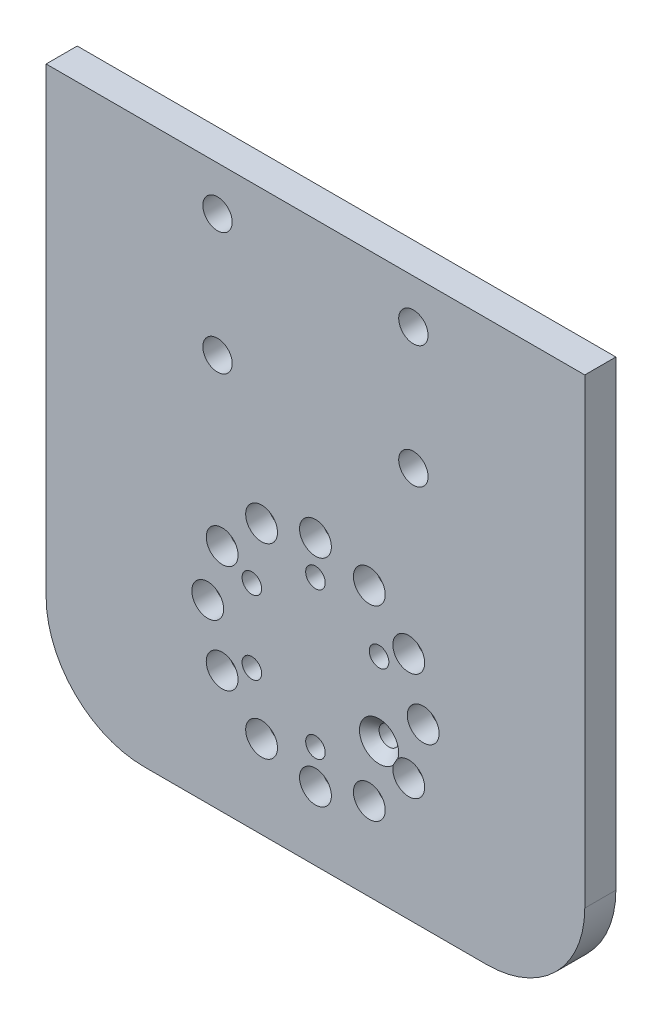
ISO-10303-21;
HEADER;
FILE_DESCRIPTION(('STEP AP214'),'2;1');
FILE_NAME('part.step','',(''),(''),'','','');
FILE_SCHEMA(('AUTOMOTIVE_DESIGN { 1 0 10303 214 1 1 1 1 }'));
ENDSEC;
DATA;
#1=APPLICATION_CONTEXT('core data for automotive mechanical design processes');
#2=APPLICATION_PROTOCOL_DEFINITION('international standard','automotive_design',2000,#1);
#3=PRODUCT_CONTEXT('',#1,'mechanical');
#4=PRODUCT('Part','Part','',(#3));
#5=PRODUCT_RELATED_PRODUCT_CATEGORY('part','',(#4));
#6=PRODUCT_DEFINITION_FORMATION('','',#4);
#7=PRODUCT_DEFINITION_CONTEXT('part definition',#1,'design');
#8=PRODUCT_DEFINITION('design','',#6,#7);
#9=PRODUCT_DEFINITION_SHAPE('','',#8);
#10=(LENGTH_UNIT() NAMED_UNIT(*) SI_UNIT(.MILLI.,.METRE.));
#11=(NAMED_UNIT(*) PLANE_ANGLE_UNIT() SI_UNIT($,.RADIAN.));
#12=(NAMED_UNIT(*) SI_UNIT($,.STERADIAN.) SOLID_ANGLE_UNIT());
#13=UNCERTAINTY_MEASURE_WITH_UNIT(LENGTH_MEASURE(1.E-05),#10,'distance_accuracy_value','');
#14=(GEOMETRIC_REPRESENTATION_CONTEXT(3) GLOBAL_UNCERTAINTY_ASSIGNED_CONTEXT((#13)) GLOBAL_UNIT_ASSIGNED_CONTEXT((#10,
#11,#12)) REPRESENTATION_CONTEXT('',''));
#15=CARTESIAN_POINT('',(0.,0.,0.));
#16=DIRECTION('',(0.,0.,1.));
#17=DIRECTION('',(1.,0.,0.));
#18=AXIS2_PLACEMENT_3D('',#15,#16,#17);
#19=CARTESIAN_POINT('',(0.,22.,6.35));
#20=DIRECTION('',(0.,0.,-1.));
#21=DIRECTION('',(-1.,0.,0.));
#22=AXIS2_PLACEMENT_3D('',#19,#20,#21);
#23=CYLINDRICAL_SURFACE('',#22,1.5);
#24=CARTESIAN_POINT('',(0.,22.,0.));
#25=DIRECTION('',(0.,0.,1.));
#26=DIRECTION('',(1.,0.,0.));
#27=AXIS2_PLACEMENT_3D('',#24,#25,#26);
#28=CIRCLE('',#27,1.5);
#29=CARTESIAN_POINT('',(1.5,22.,0.));
#30=VERTEX_POINT('',#29);
#31=EDGE_CURVE('E258',#30,#30,#28,.T.);
#32=ORIENTED_EDGE('',*,*,#31,.F.);
#33=EDGE_LOOP('',(#32));
#34=FACE_BOUND('',#33,.T.);
#35=CARTESIAN_POINT('',(0.,22.,1.85));
#36=DIRECTION('',(0.,0.,1.));
#37=DIRECTION('',(1.,0.,0.));
#38=AXIS2_PLACEMENT_3D('',#35,#36,#37);
#39=CIRCLE('',#38,1.5);
#40=CARTESIAN_POINT('',(1.5,22.,1.85));
#41=VERTEX_POINT('',#40);
#42=EDGE_CURVE('E176',#41,#41,#39,.T.);
#43=ORIENTED_EDGE('',*,*,#42,.T.);
#44=EDGE_LOOP('',(#43));
#45=FACE_BOUND('',#44,.T.);
#46=ADVANCED_FACE('F39',(#34,#45),#23,.F.);
#47=CARTESIAN_POINT('',(11.,19.0525588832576,6.35));
#48=DIRECTION('',(0.,0.,-1.));
#49=DIRECTION('',(-1.,0.,0.));
#50=AXIS2_PLACEMENT_3D('',#47,#48,#49);
#51=CYLINDRICAL_SURFACE('',#50,1.5);
#52=CARTESIAN_POINT('',(11.,19.0525588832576,0.));
#53=DIRECTION('',(0.,0.,1.));
#54=DIRECTION('',(1.,0.,0.));
#55=AXIS2_PLACEMENT_3D('',#52,#53,#54);
#56=CIRCLE('',#55,1.5);
#57=CARTESIAN_POINT('',(12.5,19.0525588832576,0.));
#58=VERTEX_POINT('',#57);
#59=EDGE_CURVE('E233',#58,#58,#56,.T.);
#60=ORIENTED_EDGE('',*,*,#59,.F.);
#61=EDGE_LOOP('',(#60));
#62=FACE_BOUND('',#61,.T.);
#63=CARTESIAN_POINT('',(11.,19.0525588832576,1.85));
#64=DIRECTION('',(0.,0.,1.));
#65=DIRECTION('',(1.,0.,0.));
#66=AXIS2_PLACEMENT_3D('',#63,#64,#65);
#67=CIRCLE('',#66,1.5);
#68=CARTESIAN_POINT('',(12.5,19.0525588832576,1.85));
#69=VERTEX_POINT('',#68);
#70=EDGE_CURVE('E339',#69,#69,#67,.T.);
#71=ORIENTED_EDGE('',*,*,#70,.T.);
#72=EDGE_LOOP('',(#71));
#73=FACE_BOUND('',#72,.T.);
#74=ADVANCED_FACE('F422',(#62,#73),#51,.F.);
#75=CARTESIAN_POINT('',(19.0525588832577,11.,6.35));
#76=DIRECTION('',(0.,0.,-1.));
#77=DIRECTION('',(-1.,0.,0.));
#78=AXIS2_PLACEMENT_3D('',#75,#76,#77);
#79=CYLINDRICAL_SURFACE('',#78,1.5);
#80=CARTESIAN_POINT('',(19.0525588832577,11.,0.));
#81=DIRECTION('',(0.,0.,1.));
#82=DIRECTION('',(1.,0.,0.));
#83=AXIS2_PLACEMENT_3D('',#80,#81,#82);
#84=CIRCLE('',#83,1.5);
#85=CARTESIAN_POINT('',(20.5525588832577,11.,0.));
#86=VERTEX_POINT('',#85);
#87=EDGE_CURVE('E226',#86,#86,#84,.T.);
#88=ORIENTED_EDGE('',*,*,#87,.F.);
#89=EDGE_LOOP('',(#88));
#90=FACE_BOUND('',#89,.T.);
#91=CARTESIAN_POINT('',(19.0525588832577,11.,1.85));
#92=DIRECTION('',(0.,0.,1.));
#93=DIRECTION('',(1.,0.,0.));
#94=AXIS2_PLACEMENT_3D('',#91,#92,#93);
#95=CIRCLE('',#94,1.5);
#96=CARTESIAN_POINT('',(20.5525588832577,11.,1.85));
#97=VERTEX_POINT('',#96);
#98=EDGE_CURVE('E337',#97,#97,#95,.T.);
#99=ORIENTED_EDGE('',*,*,#98,.T.);
#100=EDGE_LOOP('',(#99));
#101=FACE_BOUND('',#100,.T.);
#102=ADVANCED_FACE('F429',(#90,#101),#79,.F.);
#103=CARTESIAN_POINT('',(22.,0.,6.35));
#104=DIRECTION('',(0.,0.,-1.));
#105=DIRECTION('',(-1.,0.,0.));
#106=AXIS2_PLACEMENT_3D('',#103,#104,#105);
#107=CYLINDRICAL_SURFACE('',#106,1.5);
#108=CARTESIAN_POINT('',(22.,0.,0.));
#109=DIRECTION('',(0.,0.,1.));
#110=DIRECTION('',(1.,0.,0.));
#111=AXIS2_PLACEMENT_3D('',#108,#109,#110);
#112=CIRCLE('',#111,1.5);
#113=CARTESIAN_POINT('',(23.5,0.,0.));
#114=VERTEX_POINT('',#113);
#115=EDGE_CURVE('E223',#114,#114,#112,.T.);
#116=ORIENTED_EDGE('',*,*,#115,.F.);
#117=EDGE_LOOP('',(#116));
#118=FACE_BOUND('',#117,.T.);
#119=CARTESIAN_POINT('',(22.,0.,1.85));
#120=DIRECTION('',(0.,0.,1.));
#121=DIRECTION('',(1.,0.,0.));
#122=AXIS2_PLACEMENT_3D('',#119,#120,#121);
#123=CIRCLE('',#122,1.5);
#124=CARTESIAN_POINT('',(23.5,0.,1.85));
#125=VERTEX_POINT('',#124);
#126=EDGE_CURVE('E335',#125,#125,#123,.T.);
#127=ORIENTED_EDGE('',*,*,#126,.T.);
#128=EDGE_LOOP('',(#127));
#129=FACE_BOUND('',#128,.T.);
#130=ADVANCED_FACE('F540',(#118,#129),#107,.F.);
#131=CARTESIAN_POINT('',(19.0525588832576,-11.0000000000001,6.35));
#132=DIRECTION('',(0.,0.,-1.));
#133=DIRECTION('',(-1.,0.,0.));
#134=AXIS2_PLACEMENT_3D('',#131,#132,#133);
#135=CYLINDRICAL_SURFACE('',#134,1.5);
#136=CARTESIAN_POINT('',(19.0525588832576,-11.0000000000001,0.));
#137=DIRECTION('',(0.,0.,1.));
#138=DIRECTION('',(1.,0.,0.));
#139=AXIS2_PLACEMENT_3D('',#136,#137,#138);
#140=CIRCLE('',#139,1.5);
#141=CARTESIAN_POINT('',(20.5525588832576,-11.0000000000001,0.));
#142=VERTEX_POINT('',#141);
#143=EDGE_CURVE('E224',#142,#142,#140,.T.);
#144=ORIENTED_EDGE('',*,*,#143,.F.);
#145=EDGE_LOOP('',(#144));
#146=FACE_BOUND('',#145,.T.);
#147=CARTESIAN_POINT('',(19.0525588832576,-11.0000000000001,1.85));
#148=DIRECTION('',(0.,0.,1.));
#149=DIRECTION('',(1.,0.,0.));
#150=AXIS2_PLACEMENT_3D('',#147,#148,#149);
#151=CIRCLE('',#150,1.5);
#152=CARTESIAN_POINT('',(20.5525588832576,-11.0000000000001,1.85));
#153=VERTEX_POINT('',#152);
#154=EDGE_CURVE('E327',#153,#153,#151,.T.);
#155=ORIENTED_EDGE('',*,*,#154,.T.);
#156=EDGE_LOOP('',(#155));
#157=FACE_BOUND('',#156,.T.);
#158=ADVANCED_FACE('F534',(#146,#157),#135,.F.);
#159=CARTESIAN_POINT('',(10.9999999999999,-19.0525588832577,6.35));
#160=DIRECTION('',(0.,0.,-1.));
#161=DIRECTION('',(-1.,0.,0.));
#162=AXIS2_PLACEMENT_3D('',#159,#160,#161);
#163=CYLINDRICAL_SURFACE('',#162,1.5);
#164=CARTESIAN_POINT('',(10.9999999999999,-19.0525588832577,0.));
#165=DIRECTION('',(0.,0.,1.));
#166=DIRECTION('',(1.,0.,0.));
#167=AXIS2_PLACEMENT_3D('',#164,#165,#166);
#168=CIRCLE('',#167,1.5);
#169=CARTESIAN_POINT('',(12.4999999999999,-19.0525588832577,0.));
#170=VERTEX_POINT('',#169);
#171=EDGE_CURVE('E218',#170,#170,#168,.T.);
#172=ORIENTED_EDGE('',*,*,#171,.F.);
#173=EDGE_LOOP('',(#172));
#174=FACE_BOUND('',#173,.T.);
#175=CARTESIAN_POINT('',(10.9999999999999,-19.0525588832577,1.85));
#176=DIRECTION('',(0.,0.,1.));
#177=DIRECTION('',(1.,0.,0.));
#178=AXIS2_PLACEMENT_3D('',#175,#176,#177);
#179=CIRCLE('',#178,1.5);
#180=CARTESIAN_POINT('',(12.4999999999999,-19.0525588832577,1.85));
#181=VERTEX_POINT('',#180);
#182=EDGE_CURVE('E326',#181,#181,#179,.T.);
#183=ORIENTED_EDGE('',*,*,#182,.T.);
#184=EDGE_LOOP('',(#183));
#185=FACE_BOUND('',#184,.T.);
#186=ADVANCED_FACE('F529',(#174,#185),#163,.F.);
#187=CARTESIAN_POINT('',(-11.0000000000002,-19.0525588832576,6.35));
#188=DIRECTION('',(0.,0.,-1.));
#189=DIRECTION('',(-1.,0.,0.));
#190=AXIS2_PLACEMENT_3D('',#187,#188,#189);
#191=CYLINDRICAL_SURFACE('',#190,1.5);
#192=CARTESIAN_POINT('',(-11.0000000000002,-19.0525588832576,0.));
#193=DIRECTION('',(0.,0.,1.));
#194=DIRECTION('',(1.,0.,0.));
#195=AXIS2_PLACEMENT_3D('',#192,#193,#194);
#196=CIRCLE('',#195,1.5);
#197=CARTESIAN_POINT('',(-9.50000000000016,-19.0525588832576,0.));
#198=VERTEX_POINT('',#197);
#199=EDGE_CURVE('E215',#198,#198,#196,.T.);
#200=ORIENTED_EDGE('',*,*,#199,.F.);
#201=EDGE_LOOP('',(#200));
#202=FACE_BOUND('',#201,.T.);
#203=CARTESIAN_POINT('',(-11.0000000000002,-19.0525588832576,1.85));
#204=DIRECTION('',(0.,0.,1.));
#205=DIRECTION('',(1.,0.,0.));
#206=AXIS2_PLACEMENT_3D('',#203,#204,#205);
#207=CIRCLE('',#206,1.5);
#208=CARTESIAN_POINT('',(-9.50000000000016,-19.0525588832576,1.85));
#209=VERTEX_POINT('',#208);
#210=EDGE_CURVE('E323',#209,#209,#207,.T.);
#211=ORIENTED_EDGE('',*,*,#210,.T.);
#212=EDGE_LOOP('',(#211));
#213=FACE_BOUND('',#212,.T.);
#214=ADVANCED_FACE('F525',(#202,#213),#191,.F.);
#215=CARTESIAN_POINT('',(-19.0525588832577,-10.9999999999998,6.35));
#216=DIRECTION('',(0.,0.,-1.));
#217=DIRECTION('',(-1.,0.,0.));
#218=AXIS2_PLACEMENT_3D('',#215,#216,#217);
#219=CYLINDRICAL_SURFACE('',#218,1.5);
#220=CARTESIAN_POINT('',(-19.0525588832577,-10.9999999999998,0.));
#221=DIRECTION('',(0.,0.,1.));
#222=DIRECTION('',(1.,0.,0.));
#223=AXIS2_PLACEMENT_3D('',#220,#221,#222);
#224=CIRCLE('',#223,1.5);
#225=CARTESIAN_POINT('',(-17.5525588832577,-10.9999999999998,0.));
#226=VERTEX_POINT('',#225);
#227=EDGE_CURVE('E208',#226,#226,#224,.T.);
#228=ORIENTED_EDGE('',*,*,#227,.F.);
#229=EDGE_LOOP('',(#228));
#230=FACE_BOUND('',#229,.T.);
#231=CARTESIAN_POINT('',(-19.0525588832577,-10.9999999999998,1.85));
#232=DIRECTION('',(0.,0.,1.));
#233=DIRECTION('',(1.,0.,0.));
#234=AXIS2_PLACEMENT_3D('',#231,#232,#233);
#235=CIRCLE('',#234,1.5);
#236=CARTESIAN_POINT('',(-17.5525588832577,-10.9999999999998,1.85));
#237=VERTEX_POINT('',#236);
#238=EDGE_CURVE('E324',#237,#237,#235,.T.);
#239=ORIENTED_EDGE('',*,*,#238,.T.);
#240=EDGE_LOOP('',(#239));
#241=FACE_BOUND('',#240,.T.);
#242=ADVANCED_FACE('F518',(#230,#241),#219,.F.);
#243=CARTESIAN_POINT('',(-22.,2.30437768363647E-13,6.35));
#244=DIRECTION('',(0.,0.,-1.));
#245=DIRECTION('',(-1.,0.,0.));
#246=AXIS2_PLACEMENT_3D('',#243,#244,#245);
#247=CYLINDRICAL_SURFACE('',#246,1.5);
#248=CARTESIAN_POINT('',(-22.,2.30437768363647E-13,0.));
#249=DIRECTION('',(0.,0.,1.));
#250=DIRECTION('',(1.,0.,0.));
#251=AXIS2_PLACEMENT_3D('',#248,#249,#250);
#252=CIRCLE('',#251,1.5);
#253=CARTESIAN_POINT('',(-20.5,2.30437768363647E-13,0.));
#254=VERTEX_POINT('',#253);
#255=EDGE_CURVE('E210',#254,#254,#252,.T.);
#256=ORIENTED_EDGE('',*,*,#255,.F.);
#257=EDGE_LOOP('',(#256));
#258=FACE_BOUND('',#257,.T.);
#259=CARTESIAN_POINT('',(-22.,2.30437768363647E-13,1.85));
#260=DIRECTION('',(0.,0.,1.));
#261=DIRECTION('',(1.,0.,0.));
#262=AXIS2_PLACEMENT_3D('',#259,#260,#261);
#263=CIRCLE('',#262,1.5);
#264=CARTESIAN_POINT('',(-20.5,2.30437768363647E-13,1.85));
#265=VERTEX_POINT('',#264);
#266=EDGE_CURVE('E319',#265,#265,#263,.T.);
#267=ORIENTED_EDGE('',*,*,#266,.T.);
#268=EDGE_LOOP('',(#267));
#269=FACE_BOUND('',#268,.T.);
#270=ADVANCED_FACE('F513',(#258,#269),#247,.F.);
#271=CARTESIAN_POINT('',(-19.0525588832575,11.0000000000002,6.35));
#272=DIRECTION('',(0.,0.,-1.));
#273=DIRECTION('',(-1.,0.,0.));
#274=AXIS2_PLACEMENT_3D('',#271,#272,#273);
#275=CYLINDRICAL_SURFACE('',#274,1.5);
#276=CARTESIAN_POINT('',(-19.0525588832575,11.0000000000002,0.));
#277=DIRECTION('',(0.,0.,1.));
#278=DIRECTION('',(1.,0.,0.));
#279=AXIS2_PLACEMENT_3D('',#276,#277,#278);
#280=CIRCLE('',#279,1.5);
#281=CARTESIAN_POINT('',(-17.5525588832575,11.0000000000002,0.));
#282=VERTEX_POINT('',#281);
#283=EDGE_CURVE('E201',#282,#282,#280,.T.);
#284=ORIENTED_EDGE('',*,*,#283,.F.);
#285=EDGE_LOOP('',(#284));
#286=FACE_BOUND('',#285,.T.);
#287=CARTESIAN_POINT('',(-19.0525588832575,11.0000000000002,1.85));
#288=DIRECTION('',(0.,0.,1.));
#289=DIRECTION('',(1.,0.,0.));
#290=AXIS2_PLACEMENT_3D('',#287,#288,#289);
#291=CIRCLE('',#290,1.5);
#292=CARTESIAN_POINT('',(-17.5525588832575,11.0000000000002,1.85));
#293=VERTEX_POINT('',#292);
#294=EDGE_CURVE('E314',#293,#293,#291,.T.);
#295=ORIENTED_EDGE('',*,*,#294,.T.);
#296=EDGE_LOOP('',(#295));
#297=FACE_BOUND('',#296,.T.);
#298=ADVANCED_FACE('F512',(#286,#297),#275,.F.);
#299=CARTESIAN_POINT('',(-10.9999999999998,19.0525588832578,6.35));
#300=DIRECTION('',(0.,0.,-1.));
#301=DIRECTION('',(-1.,0.,0.));
#302=AXIS2_PLACEMENT_3D('',#299,#300,#301);
#303=CYLINDRICAL_SURFACE('',#302,1.5);
#304=CARTESIAN_POINT('',(-10.9999999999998,19.0525588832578,0.));
#305=DIRECTION('',(0.,0.,1.));
#306=DIRECTION('',(1.,0.,0.));
#307=AXIS2_PLACEMENT_3D('',#304,#305,#306);
#308=CIRCLE('',#307,1.5);
#309=CARTESIAN_POINT('',(-9.49999999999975,19.0525588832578,0.));
#310=VERTEX_POINT('',#309);
#311=EDGE_CURVE('E198',#310,#310,#308,.T.);
#312=ORIENTED_EDGE('',*,*,#311,.F.);
#313=EDGE_LOOP('',(#312));
#314=FACE_BOUND('',#313,.T.);
#315=CARTESIAN_POINT('',(-10.9999999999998,19.0525588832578,1.85));
#316=DIRECTION('',(0.,0.,1.));
#317=DIRECTION('',(1.,0.,0.));
#318=AXIS2_PLACEMENT_3D('',#315,#316,#317);
#319=CIRCLE('',#318,1.5);
#320=CARTESIAN_POINT('',(-9.49999999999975,19.0525588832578,1.85));
#321=VERTEX_POINT('',#320);
#322=EDGE_CURVE('E168',#321,#321,#319,.T.);
#323=ORIENTED_EDGE('',*,*,#322,.T.);
#324=EDGE_LOOP('',(#323));
#325=FACE_BOUND('',#324,.T.);
#326=ADVANCED_FACE('F507',(#314,#325),#303,.F.);
#327=CARTESIAN_POINT('',(-1.53625178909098E-13,-22.,6.35));
#328=DIRECTION('',(0.,0.,-1.));
#329=DIRECTION('',(-1.,0.,0.));
#330=AXIS2_PLACEMENT_3D('',#327,#328,#329);
#331=CYLINDRICAL_SURFACE('',#330,1.5);
#332=CARTESIAN_POINT('',(-1.53625178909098E-13,-22.,0.));
#333=DIRECTION('',(0.,0.,1.));
#334=DIRECTION('',(1.,0.,0.));
#335=AXIS2_PLACEMENT_3D('',#332,#333,#334);
#336=CIRCLE('',#335,1.5);
#337=CARTESIAN_POINT('',(1.49999999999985,-22.,0.));
#338=VERTEX_POINT('',#337);
#339=EDGE_CURVE('E219',#338,#338,#336,.T.);
#340=ORIENTED_EDGE('',*,*,#339,.F.);
#341=EDGE_LOOP('',(#340));
#342=FACE_BOUND('',#341,.T.);
#343=CARTESIAN_POINT('',(-1.53625178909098E-13,-22.,1.85));
#344=DIRECTION('',(0.,0.,1.));
#345=DIRECTION('',(1.,0.,0.));
#346=AXIS2_PLACEMENT_3D('',#343,#344,#345);
#347=CIRCLE('',#346,1.5);
#348=CARTESIAN_POINT('',(1.49999999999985,-22.,1.85));
#349=VERTEX_POINT('',#348);
#350=EDGE_CURVE('E175',#349,#349,#347,.T.);
#351=ORIENTED_EDGE('',*,*,#350,.T.);
#352=EDGE_LOOP('',(#351));
#353=FACE_BOUND('',#352,.T.);
#354=ADVANCED_FACE('F363',(#342,#353),#331,.F.);
#355=CARTESIAN_POINT('',(0.,0.,6.35));
#356=DIRECTION('',(0.,0.,1.));
#357=DIRECTION('',(1.,0.,0.));
#358=AXIS2_PLACEMENT_3D('',#355,#356,#357);
#359=PLANE('',#358);
#360=CARTESIAN_POINT('',(12.9903810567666,-7.5,6.35));
#361=DIRECTION('',(0.,0.,-1.));
#362=DIRECTION('',(-1.,0.,0.));
#363=AXIS2_PLACEMENT_3D('',#360,#361,#362);
#364=CIRCLE('',#363,4.00000000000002);
#365=CARTESIAN_POINT('',(15.888679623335,-10.2567853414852,6.35));
#366=VERTEX_POINT('',#365);
#367=CARTESIAN_POINT('',(16.8269764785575,-8.63160751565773,6.35));
#368=VERTEX_POINT('',#367);
#369=EDGE_CURVE('E56',#366,#368,#364,.T.);
#370=ORIENTED_EDGE('',*,*,#369,.T.);
#371=CARTESIAN_POINT('',(19.0525588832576,-11.0000000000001,6.35));
#372=DIRECTION('',(0.,0.,1.));
#373=DIRECTION('',(0.499999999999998,0.86602540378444,0.));
#374=AXIS2_PLACEMENT_3D('',#371,#372,#373);
#375=CIRCLE('',#374,3.25);
#376=EDGE_CURVE('E108',#366,#368,#375,.T.);
#377=ORIENTED_EDGE('',*,*,#376,.F.);
#378=EDGE_LOOP('',(#370,#377));
#379=FACE_BOUND('',#378,.T.);
#380=CARTESIAN_POINT('',(22.,0.,6.35));
#381=DIRECTION('',(0.,0.,1.));
#382=DIRECTION('',(0.,1.,0.));
#383=AXIS2_PLACEMENT_3D('',#380,#381,#382);
#384=CIRCLE('',#383,3.25);
#385=CARTESIAN_POINT('',(22.,3.24999999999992,6.35));
#386=VERTEX_POINT('',#385);
#387=EDGE_CURVE('E119',#386,#386,#384,.T.);
#388=ORIENTED_EDGE('',*,*,#387,.F.);
#389=EDGE_LOOP('',(#388));
#390=FACE_BOUND('',#389,.T.);
#391=CARTESIAN_POINT('',(19.0525588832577,11.,6.35));
#392=DIRECTION('',(0.,0.,1.));
#393=DIRECTION('',(-0.500000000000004,0.866025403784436,0.));
#394=AXIS2_PLACEMENT_3D('',#391,#392,#393);
#395=CIRCLE('',#394,3.25);
#396=CARTESIAN_POINT('',(17.4275588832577,13.8145825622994,6.35));
#397=VERTEX_POINT('',#396);
#398=EDGE_CURVE('E128',#397,#397,#395,.T.);
#399=ORIENTED_EDGE('',*,*,#398,.F.);
#400=EDGE_LOOP('',(#399));
#401=FACE_BOUND('',#400,.T.);
#402=CARTESIAN_POINT('',(11.,19.0525588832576,6.35));
#403=DIRECTION('',(0.,0.,1.));
#404=DIRECTION('',(-0.866025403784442,0.499999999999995,0.));
#405=AXIS2_PLACEMENT_3D('',#402,#403,#404);
#406=CIRCLE('',#405,3.25);
#407=CARTESIAN_POINT('',(8.18541743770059,20.6775588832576,6.35));
#408=VERTEX_POINT('',#407);
#409=EDGE_CURVE('E132',#408,#408,#406,.T.);
#410=ORIENTED_EDGE('',*,*,#409,.F.);
#411=EDGE_LOOP('',(#410));
#412=FACE_BOUND('',#411,.T.);
#413=CARTESIAN_POINT('',(1.53625178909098E-13,22.,6.35));
#414=DIRECTION('',(0.,0.,1.));
#415=DIRECTION('',(-1.,0.,0.));
#416=AXIS2_PLACEMENT_3D('',#413,#414,#415);
#417=CIRCLE('',#416,3.25);
#418=CARTESIAN_POINT('',(-3.24999999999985,22.,6.35));
#419=VERTEX_POINT('',#418);
#420=EDGE_CURVE('E142',#419,#419,#417,.T.);
#421=ORIENTED_EDGE('',*,*,#420,.F.);
#422=EDGE_LOOP('',(#421));
#423=FACE_BOUND('',#422,.T.);
#424=CARTESIAN_POINT('',(-11.,19.0525588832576,6.35));
#425=DIRECTION('',(0.,0.,1.));
#426=DIRECTION('',(-0.866025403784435,-0.500000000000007,0.));
#427=AXIS2_PLACEMENT_3D('',#424,#425,#426);
#428=CIRCLE('',#427,3.25);
#429=CARTESIAN_POINT('',(-13.8145825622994,17.4275588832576,6.35));
#430=VERTEX_POINT('',#429);
#431=EDGE_CURVE('E146',#430,#430,#428,.T.);
#432=ORIENTED_EDGE('',*,*,#431,.F.);
#433=EDGE_LOOP('',(#432));
#434=FACE_BOUND('',#433,.T.);
#435=CARTESIAN_POINT('',(-19.0525588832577,11.,6.35));
#436=DIRECTION('',(0.,0.,1.));
#437=DIRECTION('',(-0.499999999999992,-0.866025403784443,0.));
#438=AXIS2_PLACEMENT_3D('',#435,#436,#437);
#439=CIRCLE('',#438,3.25);
#440=CARTESIAN_POINT('',(-20.6775588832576,8.18541743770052,6.35));
#441=VERTEX_POINT('',#440);
#442=EDGE_CURVE('E155',#441,#441,#439,.T.);
#443=ORIENTED_EDGE('',*,*,#442,.F.);
#444=EDGE_LOOP('',(#443));
#445=FACE_BOUND('',#444,.T.);
#446=CARTESIAN_POINT('',(-22.,0.,6.35));
#447=DIRECTION('',(0.,0.,1.));
#448=DIRECTION('',(0.,-1.,0.));
#449=AXIS2_PLACEMENT_3D('',#446,#447,#448);
#450=CIRCLE('',#449,3.25);
#451=CARTESIAN_POINT('',(-22.,-3.25000000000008,6.35));
#452=VERTEX_POINT('',#451);
#453=EDGE_CURVE('E156',#452,#452,#450,.T.);
#454=ORIENTED_EDGE('',*,*,#453,.F.);
#455=EDGE_LOOP('',(#454));
#456=FACE_BOUND('',#455,.T.);
#457=CARTESIAN_POINT('',(-19.0525588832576,-11.0000000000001,6.35));
#458=DIRECTION('',(0.,0.,1.));
#459=DIRECTION('',(0.50000000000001,-0.866025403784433,0.));
#460=AXIS2_PLACEMENT_3D('',#457,#458,#459);
#461=CIRCLE('',#460,3.25);
#462=CARTESIAN_POINT('',(-17.4275588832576,-13.8145825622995,6.35));
#463=VERTEX_POINT('',#462);
#464=EDGE_CURVE('E375',#463,#463,#461,.T.);
#465=ORIENTED_EDGE('',*,*,#464,.F.);
#466=EDGE_LOOP('',(#465));
#467=FACE_BOUND('',#466,.T.);
#468=CARTESIAN_POINT('',(-10.9999999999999,-19.0525588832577,6.35));
#469=DIRECTION('',(0.,0.,1.));
#470=DIRECTION('',(0.866025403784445,-0.499999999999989,0.));
#471=AXIS2_PLACEMENT_3D('',#468,#469,#470);
#472=CIRCLE('',#471,3.25);
#473=CARTESIAN_POINT('',(-8.18541743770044,-20.6775588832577,6.35));
#474=VERTEX_POINT('',#473);
#475=EDGE_CURVE('E107',#474,#474,#472,.T.);
#476=ORIENTED_EDGE('',*,*,#475,.F.);
#477=EDGE_LOOP('',(#476));
#478=FACE_BOUND('',#477,.T.);
#479=CARTESIAN_POINT('',(10.9999999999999,-19.0525588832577,6.35));
#480=DIRECTION('',(0.,0.,1.));
#481=DIRECTION('',(0.866025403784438,0.500000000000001,0.));
#482=AXIS2_PLACEMENT_3D('',#479,#480,#481);
#483=CIRCLE('',#482,3.25);
#484=CARTESIAN_POINT('',(13.8145825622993,-17.4275588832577,6.35));
#485=VERTEX_POINT('',#484);
#486=EDGE_CURVE('E120',#485,#485,#483,.T.);
#487=ORIENTED_EDGE('',*,*,#486,.F.);
#488=EDGE_LOOP('',(#487));
#489=FACE_BOUND('',#488,.T.);
#490=CARTESIAN_POINT('',(-1.53625178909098E-13,-22.,6.35));
#491=DIRECTION('',(0.,0.,1.));
#492=DIRECTION('',(1.,0.,0.));
#493=AXIS2_PLACEMENT_3D('',#490,#491,#492);
#494=CIRCLE('',#493,3.25);
#495=CARTESIAN_POINT('',(3.24999999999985,-22.,6.35));
#496=VERTEX_POINT('',#495);
#497=EDGE_CURVE('E173',#496,#496,#494,.T.);
#498=ORIENTED_EDGE('',*,*,#497,.F.);
#499=EDGE_LOOP('',(#498));
#500=FACE_BOUND('',#499,.T.);
#501=CARTESIAN_POINT('',(20.,44.3,6.35));
#502=DIRECTION('',(0.,0.,1.));
#503=DIRECTION('',(1.,0.,0.));
#504=AXIS2_PLACEMENT_3D('',#501,#502,#503);
#505=CIRCLE('',#504,3.00000000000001);
#506=CARTESIAN_POINT('',(23.,44.3,6.35));
#507=VERTEX_POINT('',#506);
#508=EDGE_CURVE('E183',#507,#507,#505,.T.);
#509=ORIENTED_EDGE('',*,*,#508,.F.);
#510=EDGE_LOOP('',(#509));
#511=FACE_BOUND('',#510,.T.);
#512=CARTESIAN_POINT('',(-20.,69.3,6.35));
#513=DIRECTION('',(0.,0.,1.));
#514=DIRECTION('',(1.,0.,0.));
#515=AXIS2_PLACEMENT_3D('',#512,#513,#514);
#516=CIRCLE('',#515,3.00000000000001);
#517=CARTESIAN_POINT('',(-17.,69.3,6.35));
#518=VERTEX_POINT('',#517);
#519=EDGE_CURVE('E199',#518,#518,#516,.T.);
#520=ORIENTED_EDGE('',*,*,#519,.F.);
#521=EDGE_LOOP('',(#520));
#522=FACE_BOUND('',#521,.T.);
#523=CARTESIAN_POINT('',(-12.9903810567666,7.5,6.35));
#524=DIRECTION('',(0.,0.,1.));
#525=DIRECTION('',(1.,0.,0.));
#526=AXIS2_PLACEMENT_3D('',#523,#524,#525);
#527=CIRCLE('',#526,2.);
#528=CARTESIAN_POINT('',(-10.9903810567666,7.5,6.35));
#529=VERTEX_POINT('',#528);
#530=EDGE_CURVE('E232',#529,#529,#527,.T.);
#531=ORIENTED_EDGE('',*,*,#530,.F.);
#532=EDGE_LOOP('',(#531));
#533=FACE_BOUND('',#532,.T.);
#534=CARTESIAN_POINT('',(0.,-15.,6.35));
#535=DIRECTION('',(0.,0.,1.));
#536=DIRECTION('',(1.,0.,0.));
#537=AXIS2_PLACEMENT_3D('',#534,#535,#536);
#538=CIRCLE('',#537,2.);
#539=CARTESIAN_POINT('',(2.,-15.,6.35));
#540=VERTEX_POINT('',#539);
#541=EDGE_CURVE('E250',#540,#540,#538,.T.);
#542=ORIENTED_EDGE('',*,*,#541,.F.);
#543=EDGE_LOOP('',(#542));
#544=FACE_BOUND('',#543,.T.);
#545=CARTESIAN_POINT('',(12.9903810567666,7.5,6.35));
#546=DIRECTION('',(0.,0.,1.));
#547=DIRECTION('',(1.,0.,0.));
#548=AXIS2_PLACEMENT_3D('',#545,#546,#547);
#549=CIRCLE('',#548,2.);
#550=CARTESIAN_POINT('',(14.9903810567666,7.5,6.35));
#551=VERTEX_POINT('',#550);
#552=EDGE_CURVE('E259',#551,#551,#549,.T.);
#553=ORIENTED_EDGE('',*,*,#552,.F.);
#554=EDGE_LOOP('',(#553));
#555=FACE_BOUND('',#554,.T.);
#556=CARTESIAN_POINT('',(0.,15.,6.35));
#557=DIRECTION('',(0.,0.,1.));
#558=DIRECTION('',(1.,0.,0.));
#559=AXIS2_PLACEMENT_3D('',#556,#557,#558);
#560=CIRCLE('',#559,2.00000000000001);
#561=CARTESIAN_POINT('',(2.00000000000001,15.,6.35));
#562=VERTEX_POINT('',#561);
#563=EDGE_CURVE('E262',#562,#562,#560,.T.);
#564=ORIENTED_EDGE('',*,*,#563,.F.);
#565=EDGE_LOOP('',(#564));
#566=FACE_BOUND('',#565,.T.);
#567=DIRECTION('',(0.,-1.,0.));
#568=VECTOR('',#567,1.);
#569=CARTESIAN_POINT('',(-55.,-36.,6.35));
#570=LINE('',#569,#568);
#571=CARTESIAN_POINT('',(-55.,78.3,6.35));
#572=VERTEX_POINT('',#571);
#573=CARTESIAN_POINT('',(-55.,-15.9999999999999,6.35));
#574=VERTEX_POINT('',#573);
#575=EDGE_CURVE('E280',#572,#574,#570,.T.);
#576=ORIENTED_EDGE('',*,*,#575,.T.);
#577=CARTESIAN_POINT('',(-35.,-15.9999999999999,6.35));
#578=DIRECTION('',(0.,0.,1.));
#579=DIRECTION('',(1.,0.,0.));
#580=AXIS2_PLACEMENT_3D('',#577,#578,#579);
#581=CIRCLE('',#580,20.);
#582=CARTESIAN_POINT('',(-35.,-36.,6.35));
#583=VERTEX_POINT('',#582);
#584=EDGE_CURVE('E310',#574,#583,#581,.T.);
#585=ORIENTED_EDGE('',*,*,#584,.T.);
#586=DIRECTION('',(1.,0.,0.));
#587=VECTOR('',#586,1.);
#588=CARTESIAN_POINT('',(-55.,-36.,6.35));
#589=LINE('',#588,#587);
#590=CARTESIAN_POINT('',(35.,-36.,6.35));
#591=VERTEX_POINT('',#590);
#592=EDGE_CURVE('E272',#583,#591,#589,.T.);
#593=ORIENTED_EDGE('',*,*,#592,.T.);
#594=CARTESIAN_POINT('',(35.,-15.9999999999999,6.35));
#595=DIRECTION('',(0.,0.,1.));
#596=DIRECTION('',(1.,0.,0.));
#597=AXIS2_PLACEMENT_3D('',#594,#595,#596);
#598=CIRCLE('',#597,20.);
#599=CARTESIAN_POINT('',(55.,-15.9999999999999,6.35));
#600=VERTEX_POINT('',#599);
#601=EDGE_CURVE('E69',#591,#600,#598,.T.);
#602=ORIENTED_EDGE('',*,*,#601,.T.);
#603=DIRECTION('',(0.,1.,0.));
#604=VECTOR('',#603,1.);
#605=CARTESIAN_POINT('',(55.,-36.,6.35));
#606=LINE('',#605,#604);
#607=CARTESIAN_POINT('',(55.,78.3,6.35));
#608=VERTEX_POINT('',#607);
#609=EDGE_CURVE('E271',#600,#608,#606,.T.);
#610=ORIENTED_EDGE('',*,*,#609,.T.);
#611=DIRECTION('',(-1.,0.,0.));
#612=VECTOR('',#611,1.);
#613=CARTESIAN_POINT('',(-55.,78.3,6.35));
#614=LINE('',#613,#612);
#615=EDGE_CURVE('E279',#608,#572,#614,.T.);
#616=ORIENTED_EDGE('',*,*,#615,.T.);
#617=EDGE_LOOP('',(#576,#585,#593,#602,#610,#616));
#618=FACE_BOUND('',#617,.T.);
#619=CARTESIAN_POINT('',(-12.9903810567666,-7.50000000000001,6.35));
#620=DIRECTION('',(0.,0.,1.));
#621=DIRECTION('',(1.,0.,0.));
#622=AXIS2_PLACEMENT_3D('',#619,#620,#621);
#623=CIRCLE('',#622,2.);
#624=CARTESIAN_POINT('',(-10.9903810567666,-7.50000000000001,6.35));
#625=VERTEX_POINT('',#624);
#626=EDGE_CURVE('E241',#625,#625,#623,.T.);
#627=ORIENTED_EDGE('',*,*,#626,.F.);
#628=EDGE_LOOP('',(#627));
#629=FACE_BOUND('',#628,.T.);
#630=CARTESIAN_POINT('',(-20.,44.3,6.35));
#631=DIRECTION('',(0.,0.,1.));
#632=DIRECTION('',(1.,0.,0.));
#633=AXIS2_PLACEMENT_3D('',#630,#631,#632);
#634=CIRCLE('',#633,3.00000000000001);
#635=CARTESIAN_POINT('',(-17.,44.3,6.35));
#636=VERTEX_POINT('',#635);
#637=EDGE_CURVE('E188',#636,#636,#634,.T.);
#638=ORIENTED_EDGE('',*,*,#637,.F.);
#639=EDGE_LOOP('',(#638));
#640=FACE_BOUND('',#639,.T.);
#641=CARTESIAN_POINT('',(20.,69.3,6.35));
#642=DIRECTION('',(0.,0.,1.));
#643=DIRECTION('',(1.,0.,0.));
#644=AXIS2_PLACEMENT_3D('',#641,#642,#643);
#645=CIRCLE('',#644,3.00000000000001);
#646=CARTESIAN_POINT('',(23.,69.3,6.35));
#647=VERTEX_POINT('',#646);
#648=EDGE_CURVE('E180',#647,#647,#645,.T.);
#649=ORIENTED_EDGE('',*,*,#648,.F.);
#650=EDGE_LOOP('',(#649));
#651=FACE_BOUND('',#650,.T.);
#652=ADVANCED_FACE('F106',(#379,#390,#401,#412,#423,#434,#445,#456,#467,#478,#489,#500,#511,
#522,#533,#544,#555,#566,#618,#629,#640,#651),#359,.T.);
#653=CARTESIAN_POINT('',(0.,0.,0.));
#654=DIRECTION('',(0.,0.,1.));
#655=DIRECTION('',(1.,0.,0.));
#656=AXIS2_PLACEMENT_3D('',#653,#654,#655);
#657=PLANE('',#656);
#658=DIRECTION('',(1.,0.,0.));
#659=VECTOR('',#658,1.);
#660=CARTESIAN_POINT('',(-55.,-36.,0.));
#661=LINE('',#660,#659);
#662=CARTESIAN_POINT('',(-35.,-36.,0.));
#663=VERTEX_POINT('',#662);
#664=CARTESIAN_POINT('',(35.,-36.,0.));
#665=VERTEX_POINT('',#664);
#666=EDGE_CURVE('E270',#663,#665,#661,.T.);
#667=ORIENTED_EDGE('',*,*,#666,.F.);
#668=CARTESIAN_POINT('',(-35.,-15.9999999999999,0.));
#669=DIRECTION('',(0.,0.,1.));
#670=DIRECTION('',(1.,0.,0.));
#671=AXIS2_PLACEMENT_3D('',#668,#669,#670);
#672=CIRCLE('',#671,20.);
#673=CARTESIAN_POINT('',(-55.,-15.9999999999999,0.));
#674=VERTEX_POINT('',#673);
#675=EDGE_CURVE('E305',#663,#674,#672,.F.);
#676=ORIENTED_EDGE('',*,*,#675,.T.);
#677=DIRECTION('',(0.,-1.,0.));
#678=VECTOR('',#677,1.);
#679=CARTESIAN_POINT('',(-55.,-36.,0.));
#680=LINE('',#679,#678);
#681=CARTESIAN_POINT('',(-55.,78.3,0.));
#682=VERTEX_POINT('',#681);
#683=EDGE_CURVE('E274',#682,#674,#680,.T.);
#684=ORIENTED_EDGE('',*,*,#683,.F.);
#685=DIRECTION('',(-1.,0.,0.));
#686=VECTOR('',#685,1.);
#687=CARTESIAN_POINT('',(-55.,78.3,0.));
#688=LINE('',#687,#686);
#689=CARTESIAN_POINT('',(55.,78.3,0.));
#690=VERTEX_POINT('',#689);
#691=EDGE_CURVE('E287',#690,#682,#688,.T.);
#692=ORIENTED_EDGE('',*,*,#691,.F.);
#693=DIRECTION('',(0.,1.,0.));
#694=VECTOR('',#693,1.);
#695=CARTESIAN_POINT('',(55.,-36.,0.));
#696=LINE('',#695,#694);
#697=CARTESIAN_POINT('',(55.,-15.9999999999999,0.));
#698=VERTEX_POINT('',#697);
#699=EDGE_CURVE('E283',#698,#690,#696,.T.);
#700=ORIENTED_EDGE('',*,*,#699,.F.);
#701=CARTESIAN_POINT('',(35.,-15.9999999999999,0.));
#702=DIRECTION('',(0.,0.,1.));
#703=DIRECTION('',(1.,0.,0.));
#704=AXIS2_PLACEMENT_3D('',#701,#702,#703);
#705=CIRCLE('',#704,20.);
#706=EDGE_CURVE('E297',#698,#665,#705,.F.);
#707=ORIENTED_EDGE('',*,*,#706,.T.);
#708=EDGE_LOOP('',(#667,#676,#684,#692,#700,#707));
#709=FACE_BOUND('',#708,.T.);
#710=CARTESIAN_POINT('',(0.,15.,0.));
#711=DIRECTION('',(0.,0.,1.));
#712=DIRECTION('',(1.,0.,0.));
#713=AXIS2_PLACEMENT_3D('',#710,#711,#712);
#714=CIRCLE('',#713,2.00000000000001);
#715=CARTESIAN_POINT('',(2.00000000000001,15.,0.));
#716=VERTEX_POINT('',#715);
#717=EDGE_CURVE('E263',#716,#716,#714,.T.);
#718=ORIENTED_EDGE('',*,*,#717,.T.);
#719=EDGE_LOOP('',(#718));
#720=FACE_BOUND('',#719,.T.);
#721=ORIENTED_EDGE('',*,*,#31,.T.);
#722=EDGE_LOOP('',(#721));
#723=FACE_BOUND('',#722,.T.);
#724=CARTESIAN_POINT('',(12.9903810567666,7.5,0.));
#725=DIRECTION('',(0.,0.,1.));
#726=DIRECTION('',(1.,0.,0.));
#727=AXIS2_PLACEMENT_3D('',#724,#725,#726);
#728=CIRCLE('',#727,2.);
#729=CARTESIAN_POINT('',(14.9903810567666,7.5,0.));
#730=VERTEX_POINT('',#729);
#731=EDGE_CURVE('E253',#730,#730,#728,.T.);
#732=ORIENTED_EDGE('',*,*,#731,.T.);
#733=EDGE_LOOP('',(#732));
#734=FACE_BOUND('',#733,.T.);
#735=CARTESIAN_POINT('',(12.9903810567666,-7.5,0.));
#736=DIRECTION('',(0.,0.,1.));
#737=DIRECTION('',(1.,0.,0.));
#738=AXIS2_PLACEMENT_3D('',#735,#736,#737);
#739=CIRCLE('',#738,2.);
#740=CARTESIAN_POINT('',(14.9903810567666,-7.5,0.));
#741=VERTEX_POINT('',#740);
#742=EDGE_CURVE('E249',#741,#741,#739,.T.);
#743=ORIENTED_EDGE('',*,*,#742,.T.);
#744=EDGE_LOOP('',(#743));
#745=FACE_BOUND('',#744,.T.);
#746=CARTESIAN_POINT('',(0.,-15.,0.));
#747=DIRECTION('',(0.,0.,1.));
#748=DIRECTION('',(1.,0.,0.));
#749=AXIS2_PLACEMENT_3D('',#746,#747,#748);
#750=CIRCLE('',#749,2.);
#751=CARTESIAN_POINT('',(2.,-15.,0.));
#752=VERTEX_POINT('',#751);
#753=EDGE_CURVE('E242',#752,#752,#750,.T.);
#754=ORIENTED_EDGE('',*,*,#753,.T.);
#755=EDGE_LOOP('',(#754));
#756=FACE_BOUND('',#755,.T.);
#757=CARTESIAN_POINT('',(-12.9903810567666,-7.50000000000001,0.));
#758=DIRECTION('',(0.,0.,1.));
#759=DIRECTION('',(1.,0.,0.));
#760=AXIS2_PLACEMENT_3D('',#757,#758,#759);
#761=CIRCLE('',#760,2.);
#762=CARTESIAN_POINT('',(-10.9903810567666,-7.50000000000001,0.));
#763=VERTEX_POINT('',#762);
#764=EDGE_CURVE('E238',#763,#763,#761,.T.);
#765=ORIENTED_EDGE('',*,*,#764,.T.);
#766=EDGE_LOOP('',(#765));
#767=FACE_BOUND('',#766,.T.);
#768=CARTESIAN_POINT('',(-12.9903810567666,7.5,0.));
#769=DIRECTION('',(0.,0.,1.));
#770=DIRECTION('',(1.,0.,0.));
#771=AXIS2_PLACEMENT_3D('',#768,#769,#770);
#772=CIRCLE('',#771,2.);
#773=CARTESIAN_POINT('',(-10.9903810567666,7.5,0.));
#774=VERTEX_POINT('',#773);
#775=EDGE_CURVE('E234',#774,#774,#772,.T.);
#776=ORIENTED_EDGE('',*,*,#775,.T.);
#777=EDGE_LOOP('',(#776));
#778=FACE_BOUND('',#777,.T.);
#779=ORIENTED_EDGE('',*,*,#59,.T.);
#780=EDGE_LOOP('',(#779));
#781=FACE_BOUND('',#780,.T.);
#782=ORIENTED_EDGE('',*,*,#87,.T.);
#783=EDGE_LOOP('',(#782));
#784=FACE_BOUND('',#783,.T.);
#785=ORIENTED_EDGE('',*,*,#115,.T.);
#786=EDGE_LOOP('',(#785));
#787=FACE_BOUND('',#786,.T.);
#788=ORIENTED_EDGE('',*,*,#143,.T.);
#789=EDGE_LOOP('',(#788));
#790=FACE_BOUND('',#789,.T.);
#791=ORIENTED_EDGE('',*,*,#171,.T.);
#792=EDGE_LOOP('',(#791));
#793=FACE_BOUND('',#792,.T.);
#794=ORIENTED_EDGE('',*,*,#339,.T.);
#795=EDGE_LOOP('',(#794));
#796=FACE_BOUND('',#795,.T.);
#797=ORIENTED_EDGE('',*,*,#199,.T.);
#798=EDGE_LOOP('',(#797));
#799=FACE_BOUND('',#798,.T.);
#800=ORIENTED_EDGE('',*,*,#227,.T.);
#801=EDGE_LOOP('',(#800));
#802=FACE_BOUND('',#801,.T.);
#803=ORIENTED_EDGE('',*,*,#255,.T.);
#804=EDGE_LOOP('',(#803));
#805=FACE_BOUND('',#804,.T.);
#806=ORIENTED_EDGE('',*,*,#283,.T.);
#807=EDGE_LOOP('',(#806));
#808=FACE_BOUND('',#807,.T.);
#809=ORIENTED_EDGE('',*,*,#311,.T.);
#810=EDGE_LOOP('',(#809));
#811=FACE_BOUND('',#810,.T.);
#812=CARTESIAN_POINT('',(-20.,69.3,0.));
#813=DIRECTION('',(0.,0.,1.));
#814=DIRECTION('',(1.,0.,0.));
#815=AXIS2_PLACEMENT_3D('',#812,#813,#814);
#816=CIRCLE('',#815,3.00000000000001);
#817=CARTESIAN_POINT('',(-17.,69.3,0.));
#818=VERTEX_POINT('',#817);
#819=EDGE_CURVE('E195',#818,#818,#816,.T.);
#820=ORIENTED_EDGE('',*,*,#819,.T.);
#821=EDGE_LOOP('',(#820));
#822=FACE_BOUND('',#821,.T.);
#823=CARTESIAN_POINT('',(-20.,44.3,0.));
#824=DIRECTION('',(0.,0.,1.));
#825=DIRECTION('',(1.,0.,0.));
#826=AXIS2_PLACEMENT_3D('',#823,#824,#825);
#827=CIRCLE('',#826,3.00000000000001);
#828=CARTESIAN_POINT('',(-17.,44.3,0.));
#829=VERTEX_POINT('',#828);
#830=EDGE_CURVE('E190',#829,#829,#827,.T.);
#831=ORIENTED_EDGE('',*,*,#830,.T.);
#832=EDGE_LOOP('',(#831));
#833=FACE_BOUND('',#832,.T.);
#834=CARTESIAN_POINT('',(20.,44.3,0.));
#835=DIRECTION('',(0.,0.,1.));
#836=DIRECTION('',(1.,0.,0.));
#837=AXIS2_PLACEMENT_3D('',#834,#835,#836);
#838=CIRCLE('',#837,3.00000000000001);
#839=CARTESIAN_POINT('',(23.,44.3,0.));
#840=VERTEX_POINT('',#839);
#841=EDGE_CURVE('E179',#840,#840,#838,.T.);
#842=ORIENTED_EDGE('',*,*,#841,.T.);
#843=EDGE_LOOP('',(#842));
#844=FACE_BOUND('',#843,.T.);
#845=CARTESIAN_POINT('',(20.,69.3,0.));
#846=DIRECTION('',(0.,0.,1.));
#847=DIRECTION('',(1.,0.,0.));
#848=AXIS2_PLACEMENT_3D('',#845,#846,#847);
#849=CIRCLE('',#848,3.00000000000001);
#850=CARTESIAN_POINT('',(23.,69.3,0.));
#851=VERTEX_POINT('',#850);
#852=EDGE_CURVE('E181',#851,#851,#849,.T.);
#853=ORIENTED_EDGE('',*,*,#852,.T.);
#854=EDGE_LOOP('',(#853));
#855=FACE_BOUND('',#854,.T.);
#856=ADVANCED_FACE('F359',(#709,#720,#723,#734,#745,#756,#767,#778,#781,#784,#787,#790,#793,
#796,#799,#802,#805,#808,#811,#822,#833,#844,#855),#657,.F.);
#857=CARTESIAN_POINT('',(-55.,-36.,6.35));
#858=DIRECTION('',(0.,1.,0.));
#859=DIRECTION('',(0.,0.,1.));
#860=AXIS2_PLACEMENT_3D('',#857,#858,#859);
#861=PLANE('',#860);
#862=ORIENTED_EDGE('',*,*,#592,.F.);
#863=DIRECTION('',(0.,0.,-1.));
#864=VECTOR('',#863,1.);
#865=CARTESIAN_POINT('',(-35.,-36.,6.35));
#866=LINE('',#865,#864);
#867=EDGE_CURVE('E300',#583,#663,#866,.T.);
#868=ORIENTED_EDGE('',*,*,#867,.T.);
#869=ORIENTED_EDGE('',*,*,#666,.T.);
#870=DIRECTION('',(0.,0.,-1.));
#871=VECTOR('',#870,1.);
#872=CARTESIAN_POINT('',(35.,-36.,6.35));
#873=LINE('',#872,#871);
#874=EDGE_CURVE('E294',#665,#591,#873,.F.);
#875=ORIENTED_EDGE('',*,*,#874,.T.);
#876=EDGE_LOOP('',(#862,#868,#869,#875));
#877=FACE_BOUND('',#876,.T.);
#878=ADVANCED_FACE('F408',(#877),#861,.F.);
#879=CARTESIAN_POINT('',(55.,-36.,6.35));
#880=DIRECTION('',(-1.,0.,0.));
#881=DIRECTION('',(0.,0.,1.));
#882=AXIS2_PLACEMENT_3D('',#879,#880,#881);
#883=PLANE('',#882);
#884=ORIENTED_EDGE('',*,*,#609,.F.);
#885=DIRECTION('',(0.,0.,-1.));
#886=VECTOR('',#885,1.);
#887=CARTESIAN_POINT('',(55.,-15.9999999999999,6.35));
#888=LINE('',#887,#886);
#889=EDGE_CURVE('E52',#600,#698,#888,.T.);
#890=ORIENTED_EDGE('',*,*,#889,.T.);
#891=ORIENTED_EDGE('',*,*,#699,.T.);
#892=DIRECTION('',(0.,0.,-1.));
#893=VECTOR('',#892,1.);
#894=CARTESIAN_POINT('',(55.,78.3,6.35));
#895=LINE('',#894,#893);
#896=EDGE_CURVE('E292',#608,#690,#895,.T.);
#897=ORIENTED_EDGE('',*,*,#896,.F.);
#898=EDGE_LOOP('',(#884,#890,#891,#897));
#899=FACE_BOUND('',#898,.T.);
#900=ADVANCED_FACE('F412',(#899),#883,.F.);
#901=CARTESIAN_POINT('',(-55.,78.3,6.35));
#902=DIRECTION('',(0.,-1.,0.));
#903=DIRECTION('',(0.,0.,-1.));
#904=AXIS2_PLACEMENT_3D('',#901,#902,#903);
#905=PLANE('',#904);
#906=ORIENTED_EDGE('',*,*,#691,.T.);
#907=DIRECTION('',(0.,0.,-1.));
#908=VECTOR('',#907,1.);
#909=CARTESIAN_POINT('',(-55.,78.3,6.35));
#910=LINE('',#909,#908);
#911=EDGE_CURVE('E284',#572,#682,#910,.T.);
#912=ORIENTED_EDGE('',*,*,#911,.F.);
#913=ORIENTED_EDGE('',*,*,#615,.F.);
#914=ORIENTED_EDGE('',*,*,#896,.T.);
#915=EDGE_LOOP('',(#906,#912,#913,#914));
#916=FACE_BOUND('',#915,.T.);
#917=ADVANCED_FACE('F449',(#916),#905,.F.);
#918=CARTESIAN_POINT('',(-55.,-36.,6.35));
#919=DIRECTION('',(1.,0.,0.));
#920=DIRECTION('',(0.,0.,-1.));
#921=AXIS2_PLACEMENT_3D('',#918,#919,#920);
#922=PLANE('',#921);
#923=ORIENTED_EDGE('',*,*,#683,.T.);
#924=DIRECTION('',(0.,0.,-1.));
#925=VECTOR('',#924,1.);
#926=CARTESIAN_POINT('',(-55.,-15.9999999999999,6.35));
#927=LINE('',#926,#925);
#928=EDGE_CURVE('E302',#674,#574,#927,.F.);
#929=ORIENTED_EDGE('',*,*,#928,.T.);
#930=ORIENTED_EDGE('',*,*,#575,.F.);
#931=ORIENTED_EDGE('',*,*,#911,.T.);
#932=EDGE_LOOP('',(#923,#929,#930,#931));
#933=FACE_BOUND('',#932,.T.);
#934=ADVANCED_FACE('F437',(#933),#922,.F.);
#935=CARTESIAN_POINT('',(0.,15.,6.35));
#936=DIRECTION('',(0.,0.,-1.));
#937=DIRECTION('',(-1.,0.,0.));
#938=AXIS2_PLACEMENT_3D('',#935,#936,#937);
#939=CYLINDRICAL_SURFACE('',#938,2.00000000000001);
#940=ORIENTED_EDGE('',*,*,#563,.T.);
#941=EDGE_LOOP('',(#940));
#942=FACE_BOUND('',#941,.T.);
#943=ORIENTED_EDGE('',*,*,#717,.F.);
#944=EDGE_LOOP('',(#943));
#945=FACE_BOUND('',#944,.T.);
#946=ADVANCED_FACE('F440',(#942,#945),#939,.F.);
#947=CARTESIAN_POINT('',(12.9903810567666,7.5,6.35));
#948=DIRECTION('',(0.,0.,-1.));
#949=DIRECTION('',(-1.,0.,0.));
#950=AXIS2_PLACEMENT_3D('',#947,#948,#949);
#951=CYLINDRICAL_SURFACE('',#950,2.);
#952=ORIENTED_EDGE('',*,*,#552,.T.);
#953=EDGE_LOOP('',(#952));
#954=FACE_BOUND('',#953,.T.);
#955=ORIENTED_EDGE('',*,*,#731,.F.);
#956=EDGE_LOOP('',(#955));
#957=FACE_BOUND('',#956,.T.);
#958=ADVANCED_FACE('F434',(#954,#957),#951,.F.);
#959=CARTESIAN_POINT('',(12.9903810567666,-7.5,6.35));
#960=DIRECTION('',(0.,0.,-1.));
#961=DIRECTION('',(-1.,0.,0.));
#962=AXIS2_PLACEMENT_3D('',#959,#960,#961);
#963=CYLINDRICAL_SURFACE('',#962,2.);
#964=CARTESIAN_POINT('',(12.9903810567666,-7.5,4.35));
#965=DIRECTION('',(0.,0.,-1.));
#966=DIRECTION('',(-1.,0.,0.));
#967=AXIS2_PLACEMENT_3D('',#964,#965,#966);
#968=CIRCLE('',#967,2.);
#969=CARTESIAN_POINT('',(10.9903810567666,-7.5,4.35));
#970=VERTEX_POINT('',#969);
#971=EDGE_CURVE('E109',#970,#970,#968,.T.);
#972=ORIENTED_EDGE('',*,*,#971,.F.);
#973=EDGE_LOOP('',(#972));
#974=FACE_BOUND('',#973,.T.);
#975=ORIENTED_EDGE('',*,*,#742,.F.);
#976=EDGE_LOOP('',(#975));
#977=FACE_BOUND('',#976,.T.);
#978=ADVANCED_FACE('F444',(#974,#977),#963,.F.);
#979=CARTESIAN_POINT('',(0.,-15.,6.35));
#980=DIRECTION('',(0.,0.,-1.));
#981=DIRECTION('',(-1.,0.,0.));
#982=AXIS2_PLACEMENT_3D('',#979,#980,#981);
#983=CYLINDRICAL_SURFACE('',#982,2.);
#984=ORIENTED_EDGE('',*,*,#541,.T.);
#985=EDGE_LOOP('',(#984));
#986=FACE_BOUND('',#985,.T.);
#987=ORIENTED_EDGE('',*,*,#753,.F.);
#988=EDGE_LOOP('',(#987));
#989=FACE_BOUND('',#988,.T.);
#990=ADVANCED_FACE('F552',(#986,#989),#983,.F.);
#991=CARTESIAN_POINT('',(-12.9903810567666,-7.50000000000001,6.35));
#992=DIRECTION('',(0.,0.,-1.));
#993=DIRECTION('',(-1.,0.,0.));
#994=AXIS2_PLACEMENT_3D('',#991,#992,#993);
#995=CYLINDRICAL_SURFACE('',#994,2.);
#996=ORIENTED_EDGE('',*,*,#626,.T.);
#997=EDGE_LOOP('',(#996));
#998=FACE_BOUND('',#997,.T.);
#999=ORIENTED_EDGE('',*,*,#764,.F.);
#1000=EDGE_LOOP('',(#999));
#1001=FACE_BOUND('',#1000,.T.);
#1002=ADVANCED_FACE('F550',(#998,#1001),#995,.F.);
#1003=CARTESIAN_POINT('',(-12.9903810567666,7.5,6.35));
#1004=DIRECTION('',(0.,0.,-1.));
#1005=DIRECTION('',(-1.,0.,0.));
#1006=AXIS2_PLACEMENT_3D('',#1003,#1004,#1005);
#1007=CYLINDRICAL_SURFACE('',#1006,2.);
#1008=ORIENTED_EDGE('',*,*,#530,.T.);
#1009=EDGE_LOOP('',(#1008));
#1010=FACE_BOUND('',#1009,.T.);
#1011=ORIENTED_EDGE('',*,*,#775,.F.);
#1012=EDGE_LOOP('',(#1011));
#1013=FACE_BOUND('',#1012,.T.);
#1014=ADVANCED_FACE('F506',(#1010,#1013),#1007,.F.);
#1015=CARTESIAN_POINT('',(-20.,69.3,6.35));
#1016=DIRECTION('',(0.,0.,-1.));
#1017=DIRECTION('',(-1.,0.,0.));
#1018=AXIS2_PLACEMENT_3D('',#1015,#1016,#1017);
#1019=CYLINDRICAL_SURFACE('',#1018,3.00000000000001);
#1020=ORIENTED_EDGE('',*,*,#519,.T.);
#1021=EDGE_LOOP('',(#1020));
#1022=FACE_BOUND('',#1021,.T.);
#1023=ORIENTED_EDGE('',*,*,#819,.F.);
#1024=EDGE_LOOP('',(#1023));
#1025=FACE_BOUND('',#1024,.T.);
#1026=ADVANCED_FACE('F497',(#1022,#1025),#1019,.F.);
#1027=CARTESIAN_POINT('',(-20.,44.3,6.35));
#1028=DIRECTION('',(0.,0.,-1.));
#1029=DIRECTION('',(-1.,0.,0.));
#1030=AXIS2_PLACEMENT_3D('',#1027,#1028,#1029);
#1031=CYLINDRICAL_SURFACE('',#1030,3.00000000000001);
#1032=ORIENTED_EDGE('',*,*,#637,.T.);
#1033=EDGE_LOOP('',(#1032));
#1034=FACE_BOUND('',#1033,.T.);
#1035=ORIENTED_EDGE('',*,*,#830,.F.);
#1036=EDGE_LOOP('',(#1035));
#1037=FACE_BOUND('',#1036,.T.);
#1038=ADVANCED_FACE('F491',(#1034,#1037),#1031,.F.);
#1039=CARTESIAN_POINT('',(20.,44.3,6.35));
#1040=DIRECTION('',(0.,0.,-1.));
#1041=DIRECTION('',(-1.,0.,0.));
#1042=AXIS2_PLACEMENT_3D('',#1039,#1040,#1041);
#1043=CYLINDRICAL_SURFACE('',#1042,3.00000000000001);
#1044=ORIENTED_EDGE('',*,*,#508,.T.);
#1045=EDGE_LOOP('',(#1044));
#1046=FACE_BOUND('',#1045,.T.);
#1047=ORIENTED_EDGE('',*,*,#841,.F.);
#1048=EDGE_LOOP('',(#1047));
#1049=FACE_BOUND('',#1048,.T.);
#1050=ADVANCED_FACE('F404',(#1046,#1049),#1043,.F.);
#1051=CARTESIAN_POINT('',(20.,69.3,6.35));
#1052=DIRECTION('',(0.,0.,-1.));
#1053=DIRECTION('',(-1.,0.,0.));
#1054=AXIS2_PLACEMENT_3D('',#1051,#1052,#1053);
#1055=CYLINDRICAL_SURFACE('',#1054,3.00000000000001);
#1056=ORIENTED_EDGE('',*,*,#648,.T.);
#1057=EDGE_LOOP('',(#1056));
#1058=FACE_BOUND('',#1057,.T.);
#1059=ORIENTED_EDGE('',*,*,#852,.F.);
#1060=EDGE_LOOP('',(#1059));
#1061=FACE_BOUND('',#1060,.T.);
#1062=ADVANCED_FACE('F398',(#1058,#1061),#1055,.F.);
#1063=CARTESIAN_POINT('',(-35.,-15.9999999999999,6.35));
#1064=DIRECTION('',(0.,0.,-1.));
#1065=DIRECTION('',(-1.,0.,0.));
#1066=AXIS2_PLACEMENT_3D('',#1063,#1064,#1065);
#1067=CYLINDRICAL_SURFACE('',#1066,20.);
#1068=ORIENTED_EDGE('',*,*,#584,.F.);
#1069=ORIENTED_EDGE('',*,*,#928,.F.);
#1070=ORIENTED_EDGE('',*,*,#675,.F.);
#1071=ORIENTED_EDGE('',*,*,#867,.F.);
#1072=EDGE_LOOP('',(#1068,#1069,#1070,#1071));
#1073=FACE_BOUND('',#1072,.T.);
#1074=ADVANCED_FACE('F401',(#1073),#1067,.T.);
#1075=CARTESIAN_POINT('',(35.,-15.9999999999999,6.35));
#1076=DIRECTION('',(0.,0.,-1.));
#1077=DIRECTION('',(-1.,0.,0.));
#1078=AXIS2_PLACEMENT_3D('',#1075,#1076,#1077);
#1079=CYLINDRICAL_SURFACE('',#1078,20.);
#1080=ORIENTED_EDGE('',*,*,#601,.F.);
#1081=ORIENTED_EDGE('',*,*,#874,.F.);
#1082=ORIENTED_EDGE('',*,*,#706,.F.);
#1083=ORIENTED_EDGE('',*,*,#889,.F.);
#1084=EDGE_LOOP('',(#1080,#1081,#1082,#1083));
#1085=FACE_BOUND('',#1084,.T.);
#1086=ADVANCED_FACE('F41',(#1085),#1079,.T.);
#1087=CARTESIAN_POINT('',(-1.53625178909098E-13,-22.,1.85));
#1088=DIRECTION('',(0.,0.,1.));
#1089=DIRECTION('',(1.,0.,0.));
#1090=AXIS2_PLACEMENT_3D('',#1087,#1088,#1089);
#1091=CYLINDRICAL_SURFACE('',#1090,3.25);
#1092=CARTESIAN_POINT('',(-1.53625178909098E-13,-22.,1.85));
#1093=DIRECTION('',(0.,0.,1.));
#1094=DIRECTION('',(1.,0.,0.));
#1095=AXIS2_PLACEMENT_3D('',#1092,#1093,#1094);
#1096=CIRCLE('',#1095,3.25);
#1097=CARTESIAN_POINT('',(3.24999999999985,-22.,1.85));
#1098=VERTEX_POINT('',#1097);
#1099=EDGE_CURVE('E169',#1098,#1098,#1096,.T.);
#1100=ORIENTED_EDGE('',*,*,#1099,.F.);
#1101=EDGE_LOOP('',(#1100));
#1102=FACE_BOUND('',#1101,.T.);
#1103=ORIENTED_EDGE('',*,*,#497,.T.);
#1104=EDGE_LOOP('',(#1103));
#1105=FACE_BOUND('',#1104,.T.);
#1106=ADVANCED_FACE('F655',(#1102,#1105),#1091,.F.);
#1107=CARTESIAN_POINT('',(-1.53625178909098E-13,-22.,1.85));
#1108=DIRECTION('',(0.,0.,1.));
#1109=DIRECTION('',(1.,0.,0.));
#1110=AXIS2_PLACEMENT_3D('',#1107,#1108,#1109);
#1111=PLANE('',#1110);
#1112=ORIENTED_EDGE('',*,*,#350,.F.);
#1113=EDGE_LOOP('',(#1112));
#1114=FACE_BOUND('',#1113,.T.);
#1115=ORIENTED_EDGE('',*,*,#1099,.T.);
#1116=EDGE_LOOP('',(#1115));
#1117=FACE_BOUND('',#1116,.T.);
#1118=ADVANCED_FACE('F629',(#1114,#1117),#1111,.T.);
#1119=CARTESIAN_POINT('',(-11.,19.0525588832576,1.85));
#1120=DIRECTION('',(0.,0.,1.));
#1121=DIRECTION('',(1.,0.,0.));
#1122=AXIS2_PLACEMENT_3D('',#1119,#1120,#1121);
#1123=CYLINDRICAL_SURFACE('',#1122,3.25);
#1124=CARTESIAN_POINT('',(-11.,19.0525588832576,1.85));
#1125=DIRECTION('',(0.,0.,1.));
#1126=DIRECTION('',(-0.866025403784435,-0.500000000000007,0.));
#1127=AXIS2_PLACEMENT_3D('',#1124,#1125,#1126);
#1128=CIRCLE('',#1127,3.25);
#1129=CARTESIAN_POINT('',(-13.8145825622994,17.4275588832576,1.85));
#1130=VERTEX_POINT('',#1129);
#1131=EDGE_CURVE('E144',#1130,#1130,#1128,.T.);
#1132=ORIENTED_EDGE('',*,*,#1131,.F.);
#1133=EDGE_LOOP('',(#1132));
#1134=FACE_BOUND('',#1133,.T.);
#1135=ORIENTED_EDGE('',*,*,#431,.T.);
#1136=EDGE_LOOP('',(#1135));
#1137=FACE_BOUND('',#1136,.T.);
#1138=ADVANCED_FACE('F626',(#1134,#1137),#1123,.F.);
#1139=CARTESIAN_POINT('',(-11.,19.0525588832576,1.85));
#1140=DIRECTION('',(0.,0.,1.));
#1141=DIRECTION('',(-0.866025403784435,-0.500000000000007,0.));
#1142=AXIS2_PLACEMENT_3D('',#1139,#1140,#1141);
#1143=PLANE('',#1142);
#1144=ORIENTED_EDGE('',*,*,#322,.F.);
#1145=EDGE_LOOP('',(#1144));
#1146=FACE_BOUND('',#1145,.T.);
#1147=ORIENTED_EDGE('',*,*,#1131,.T.);
#1148=EDGE_LOOP('',(#1147));
#1149=FACE_BOUND('',#1148,.T.);
#1150=ADVANCED_FACE('F625',(#1146,#1149),#1143,.T.);
#1151=CARTESIAN_POINT('',(-19.0525588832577,11.,1.85));
#1152=DIRECTION('',(0.,0.,1.));
#1153=DIRECTION('',(1.,0.,0.));
#1154=AXIS2_PLACEMENT_3D('',#1151,#1152,#1153);
#1155=CYLINDRICAL_SURFACE('',#1154,3.25);
#1156=CARTESIAN_POINT('',(-19.0525588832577,11.,1.85));
#1157=DIRECTION('',(0.,0.,1.));
#1158=DIRECTION('',(-0.499999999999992,-0.866025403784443,0.));
#1159=AXIS2_PLACEMENT_3D('',#1156,#1157,#1158);
#1160=CIRCLE('',#1159,3.25);
#1161=CARTESIAN_POINT('',(-20.6775588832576,8.18541743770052,1.85));
#1162=VERTEX_POINT('',#1161);
#1163=EDGE_CURVE('E147',#1162,#1162,#1160,.T.);
#1164=ORIENTED_EDGE('',*,*,#1163,.F.);
#1165=EDGE_LOOP('',(#1164));
#1166=FACE_BOUND('',#1165,.T.);
#1167=ORIENTED_EDGE('',*,*,#442,.T.);
#1168=EDGE_LOOP('',(#1167));
#1169=FACE_BOUND('',#1168,.T.);
#1170=ADVANCED_FACE('F622',(#1166,#1169),#1155,.F.);
#1171=CARTESIAN_POINT('',(-19.0525588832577,11.,1.85));
#1172=DIRECTION('',(0.,0.,1.));
#1173=DIRECTION('',(-0.499999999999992,-0.866025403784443,0.));
#1174=AXIS2_PLACEMENT_3D('',#1171,#1172,#1173);
#1175=PLANE('',#1174);
#1176=ORIENTED_EDGE('',*,*,#294,.F.);
#1177=EDGE_LOOP('',(#1176));
#1178=FACE_BOUND('',#1177,.T.);
#1179=ORIENTED_EDGE('',*,*,#1163,.T.);
#1180=EDGE_LOOP('',(#1179));
#1181=FACE_BOUND('',#1180,.T.);
#1182=ADVANCED_FACE('F635',(#1178,#1181),#1175,.T.);
#1183=CARTESIAN_POINT('',(-22.,0.,1.85));
#1184=DIRECTION('',(0.,0.,1.));
#1185=DIRECTION('',(1.,0.,0.));
#1186=AXIS2_PLACEMENT_3D('',#1183,#1184,#1185);
#1187=CYLINDRICAL_SURFACE('',#1186,3.25);
#1188=CARTESIAN_POINT('',(-22.,0.,1.85));
#1189=DIRECTION('',(0.,0.,1.));
#1190=DIRECTION('',(0.,-1.,0.));
#1191=AXIS2_PLACEMENT_3D('',#1188,#1189,#1190);
#1192=CIRCLE('',#1191,3.25);
#1193=CARTESIAN_POINT('',(-22.,-3.25000000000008,1.85));
#1194=VERTEX_POINT('',#1193);
#1195=EDGE_CURVE('E157',#1194,#1194,#1192,.T.);
#1196=ORIENTED_EDGE('',*,*,#1195,.F.);
#1197=EDGE_LOOP('',(#1196));
#1198=FACE_BOUND('',#1197,.T.);
#1199=ORIENTED_EDGE('',*,*,#453,.T.);
#1200=EDGE_LOOP('',(#1199));
#1201=FACE_BOUND('',#1200,.T.);
#1202=ADVANCED_FACE('F634',(#1198,#1201),#1187,.F.);
#1203=CARTESIAN_POINT('',(-22.,0.,1.85));
#1204=DIRECTION('',(0.,0.,1.));
#1205=DIRECTION('',(0.,-1.,0.));
#1206=AXIS2_PLACEMENT_3D('',#1203,#1204,#1205);
#1207=PLANE('',#1206);
#1208=ORIENTED_EDGE('',*,*,#266,.F.);
#1209=EDGE_LOOP('',(#1208));
#1210=FACE_BOUND('',#1209,.T.);
#1211=ORIENTED_EDGE('',*,*,#1195,.T.);
#1212=EDGE_LOOP('',(#1211));
#1213=FACE_BOUND('',#1212,.T.);
#1214=ADVANCED_FACE('F639',(#1210,#1213),#1207,.T.);
#1215=CARTESIAN_POINT('',(-19.0525588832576,-11.0000000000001,1.85));
#1216=DIRECTION('',(0.,0.,1.));
#1217=DIRECTION('',(1.,0.,0.));
#1218=AXIS2_PLACEMENT_3D('',#1215,#1216,#1217);
#1219=CYLINDRICAL_SURFACE('',#1218,3.25);
#1220=CARTESIAN_POINT('',(-19.0525588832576,-11.0000000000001,1.85));
#1221=DIRECTION('',(0.,0.,1.));
#1222=DIRECTION('',(0.50000000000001,-0.866025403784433,0.));
#1223=AXIS2_PLACEMENT_3D('',#1220,#1221,#1222);
#1224=CIRCLE('',#1223,3.25);
#1225=CARTESIAN_POINT('',(-17.4275588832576,-13.8145825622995,1.85));
#1226=VERTEX_POINT('',#1225);
#1227=EDGE_CURVE('E162',#1226,#1226,#1224,.T.);
#1228=ORIENTED_EDGE('',*,*,#1227,.F.);
#1229=EDGE_LOOP('',(#1228));
#1230=FACE_BOUND('',#1229,.T.);
#1231=ORIENTED_EDGE('',*,*,#464,.T.);
#1232=EDGE_LOOP('',(#1231));
#1233=FACE_BOUND('',#1232,.T.);
#1234=ADVANCED_FACE('F589',(#1230,#1233),#1219,.F.);
#1235=CARTESIAN_POINT('',(-19.0525588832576,-11.0000000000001,1.85));
#1236=DIRECTION('',(0.,0.,1.));
#1237=DIRECTION('',(0.50000000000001,-0.866025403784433,0.));
#1238=AXIS2_PLACEMENT_3D('',#1235,#1236,#1237);
#1239=PLANE('',#1238);
#1240=ORIENTED_EDGE('',*,*,#238,.F.);
#1241=EDGE_LOOP('',(#1240));
#1242=FACE_BOUND('',#1241,.T.);
#1243=ORIENTED_EDGE('',*,*,#1227,.T.);
#1244=EDGE_LOOP('',(#1243));
#1245=FACE_BOUND('',#1244,.T.);
#1246=ADVANCED_FACE('F577',(#1242,#1245),#1239,.T.);
#1247=CARTESIAN_POINT('',(-10.9999999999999,-19.0525588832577,1.85));
#1248=DIRECTION('',(0.,0.,1.));
#1249=DIRECTION('',(1.,0.,0.));
#1250=AXIS2_PLACEMENT_3D('',#1247,#1248,#1249);
#1251=CYLINDRICAL_SURFACE('',#1250,3.25);
#1252=CARTESIAN_POINT('',(-10.9999999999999,-19.0525588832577,1.85));
#1253=DIRECTION('',(0.,0.,1.));
#1254=DIRECTION('',(0.866025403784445,-0.499999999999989,0.));
#1255=AXIS2_PLACEMENT_3D('',#1252,#1253,#1254);
#1256=CIRCLE('',#1255,3.25);
#1257=CARTESIAN_POINT('',(-8.18541743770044,-20.6775588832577,1.85));
#1258=VERTEX_POINT('',#1257);
#1259=EDGE_CURVE('E569',#1258,#1258,#1256,.T.);
#1260=ORIENTED_EDGE('',*,*,#1259,.F.);
#1261=EDGE_LOOP('',(#1260));
#1262=FACE_BOUND('',#1261,.T.);
#1263=ORIENTED_EDGE('',*,*,#475,.T.);
#1264=EDGE_LOOP('',(#1263));
#1265=FACE_BOUND('',#1264,.T.);
#1266=ADVANCED_FACE('F572',(#1262,#1265),#1251,.F.);
#1267=CARTESIAN_POINT('',(-10.9999999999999,-19.0525588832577,1.85));
#1268=DIRECTION('',(0.,0.,1.));
#1269=DIRECTION('',(0.866025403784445,-0.499999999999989,0.));
#1270=AXIS2_PLACEMENT_3D('',#1267,#1268,#1269);
#1271=PLANE('',#1270);
#1272=ORIENTED_EDGE('',*,*,#210,.F.);
#1273=EDGE_LOOP('',(#1272));
#1274=FACE_BOUND('',#1273,.T.);
#1275=ORIENTED_EDGE('',*,*,#1259,.T.);
#1276=EDGE_LOOP('',(#1275));
#1277=FACE_BOUND('',#1276,.T.);
#1278=ADVANCED_FACE('F574',(#1274,#1277),#1271,.T.);
#1279=CARTESIAN_POINT('',(10.9999999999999,-19.0525588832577,1.85));
#1280=DIRECTION('',(0.,0.,1.));
#1281=DIRECTION('',(1.,0.,0.));
#1282=AXIS2_PLACEMENT_3D('',#1279,#1280,#1281);
#1283=CYLINDRICAL_SURFACE('',#1282,3.25);
#1284=CARTESIAN_POINT('',(10.9999999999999,-19.0525588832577,1.85));
#1285=DIRECTION('',(0.,0.,1.));
#1286=DIRECTION('',(0.866025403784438,0.500000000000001,0.));
#1287=AXIS2_PLACEMENT_3D('',#1284,#1285,#1286);
#1288=CIRCLE('',#1287,3.25);
#1289=CARTESIAN_POINT('',(13.8145825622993,-17.4275588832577,1.85));
#1290=VERTEX_POINT('',#1289);
#1291=EDGE_CURVE('E161',#1290,#1290,#1288,.T.);
#1292=ORIENTED_EDGE('',*,*,#1291,.F.);
#1293=EDGE_LOOP('',(#1292));
#1294=FACE_BOUND('',#1293,.T.);
#1295=ORIENTED_EDGE('',*,*,#486,.T.);
#1296=EDGE_LOOP('',(#1295));
#1297=FACE_BOUND('',#1296,.T.);
#1298=ADVANCED_FACE('F585',(#1294,#1297),#1283,.F.);
#1299=CARTESIAN_POINT('',(10.9999999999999,-19.0525588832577,1.85));
#1300=DIRECTION('',(0.,0.,1.));
#1301=DIRECTION('',(0.866025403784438,0.500000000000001,0.));
#1302=AXIS2_PLACEMENT_3D('',#1299,#1300,#1301);
#1303=PLANE('',#1302);
#1304=ORIENTED_EDGE('',*,*,#182,.F.);
#1305=EDGE_LOOP('',(#1304));
#1306=FACE_BOUND('',#1305,.T.);
#1307=ORIENTED_EDGE('',*,*,#1291,.T.);
#1308=EDGE_LOOP('',(#1307));
#1309=FACE_BOUND('',#1308,.T.);
#1310=ADVANCED_FACE('F596',(#1306,#1309),#1303,.T.);
#1311=CARTESIAN_POINT('',(19.0525588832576,-11.0000000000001,1.85));
#1312=DIRECTION('',(0.,0.,1.));
#1313=DIRECTION('',(1.,0.,0.));
#1314=AXIS2_PLACEMENT_3D('',#1311,#1312,#1313);
#1315=CYLINDRICAL_SURFACE('',#1314,3.25);
#1316=CARTESIAN_POINT('',(19.0525588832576,-11.0000000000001,1.85));
#1317=DIRECTION('',(0.,0.,1.));
#1318=DIRECTION('',(0.499999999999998,0.86602540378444,0.));
#1319=AXIS2_PLACEMENT_3D('',#1316,#1317,#1318);
#1320=CIRCLE('',#1319,3.25);
#1321=CARTESIAN_POINT('',(20.6775588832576,-8.18541743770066,1.85));
#1322=VERTEX_POINT('',#1321);
#1323=EDGE_CURVE('E113',#1322,#1322,#1320,.T.);
#1324=ORIENTED_EDGE('',*,*,#1323,.F.);
#1325=EDGE_LOOP('',(#1324));
#1326=FACE_BOUND('',#1325,.T.);
#1327=ORIENTED_EDGE('',*,*,#376,.T.);
#1328=CARTESIAN_POINT('',(16.8272649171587,-8.63133650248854,6.3502));
#1329=CARTESIAN_POINT('',(16.7632308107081,-8.6914375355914,6.3057543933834));
#1330=CARTESIAN_POINT('',(16.6998461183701,-8.75593045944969,6.26536711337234));
#1331=CARTESIAN_POINT('',(16.5756506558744,-8.89380970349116,6.1957073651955));
#1332=CARTESIAN_POINT('',(16.5148624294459,-8.96725836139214,6.16651944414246));
#1333=CARTESIAN_POINT('',(16.397616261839,-9.12294629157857,6.12281911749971));
#1334=CARTESIAN_POINT('',(16.3412016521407,-9.2052579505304,6.10843957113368));
#1335=CARTESIAN_POINT('',(16.2360436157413,-9.37529384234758,6.09715438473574));
#1336=CARTESIAN_POINT('',(16.1872658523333,-9.46299122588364,6.10016807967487));
#1337=CARTESIAN_POINT('',(16.103996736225,-9.63025594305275,6.12159846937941));
#1338=CARTESIAN_POINT('',(16.0685024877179,-9.70957783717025,6.13817675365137));
#1339=CARTESIAN_POINT('',(16.0047898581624,-9.86821610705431,6.18252675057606));
#1340=CARTESIAN_POINT('',(15.9765919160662,-9.94753185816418,6.2103293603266));
#1341=CARTESIAN_POINT('',(15.9396594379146,-10.0650999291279,6.25852339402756));
#1342=CARTESIAN_POINT('',(15.9282676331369,-10.1039461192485,6.27561181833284));
#1343=CARTESIAN_POINT('',(15.9071947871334,-10.1809964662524,6.31160148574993));
#1344=CARTESIAN_POINT('',(15.8975049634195,-10.2192029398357,6.33049259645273));
#1345=CARTESIAN_POINT('',(15.8885891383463,-10.2571706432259,6.3502));
#1346=B_SPLINE_CURVE_WITH_KNOTS('',3,(#1328,#1329,#1330,#1331,#1332,#1333,#1334,#1335,#1336,
#1337,#1338,#1339,#1340,#1341,#1342,#1343,#1344,#1345),.UNSPECIFIED.,.F.,.F.,(4,2,2,2,2,2,2,2,
4),(0.,0.295761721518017,0.593714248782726,0.894317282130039,1.19352732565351,1.45782258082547,
1.7228503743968,1.85461411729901,1.98567657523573),.UNSPECIFIED.);
#1347=EDGE_CURVE('E11',#368,#366,#1346,.T.);
#1348=ORIENTED_EDGE('',*,*,#1347,.T.);
#1349=EDGE_LOOP('',(#1327,#1348));
#1350=FACE_BOUND('',#1349,.T.);
#1351=ADVANCED_FACE('F115',(#1326,#1350),#1315,.F.);
#1352=CARTESIAN_POINT('',(19.0525588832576,-11.0000000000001,1.85));
#1353=DIRECTION('',(0.,0.,1.));
#1354=DIRECTION('',(0.499999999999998,0.86602540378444,0.));
#1355=AXIS2_PLACEMENT_3D('',#1352,#1353,#1354);
#1356=PLANE('',#1355);
#1357=ORIENTED_EDGE('',*,*,#154,.F.);
#1358=EDGE_LOOP('',(#1357));
#1359=FACE_BOUND('',#1358,.T.);
#1360=ORIENTED_EDGE('',*,*,#1323,.T.);
#1361=EDGE_LOOP('',(#1360));
#1362=FACE_BOUND('',#1361,.T.);
#1363=ADVANCED_FACE('F594',(#1359,#1362),#1356,.T.);
#1364=CARTESIAN_POINT('',(22.,0.,1.85));
#1365=DIRECTION('',(0.,0.,1.));
#1366=DIRECTION('',(1.,0.,0.));
#1367=AXIS2_PLACEMENT_3D('',#1364,#1365,#1366);
#1368=CYLINDRICAL_SURFACE('',#1367,3.25);
#1369=CARTESIAN_POINT('',(22.,0.,1.85));
#1370=DIRECTION('',(0.,0.,1.));
#1371=DIRECTION('',(0.,1.,0.));
#1372=AXIS2_PLACEMENT_3D('',#1369,#1370,#1371);
#1373=CIRCLE('',#1372,3.25);
#1374=CARTESIAN_POINT('',(22.,3.24999999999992,1.85));
#1375=VERTEX_POINT('',#1374);
#1376=EDGE_CURVE('E112',#1375,#1375,#1373,.T.);
#1377=ORIENTED_EDGE('',*,*,#1376,.F.);
#1378=EDGE_LOOP('',(#1377));
#1379=FACE_BOUND('',#1378,.T.);
#1380=ORIENTED_EDGE('',*,*,#387,.T.);
#1381=EDGE_LOOP('',(#1380));
#1382=FACE_BOUND('',#1381,.T.);
#1383=ADVANCED_FACE('F591',(#1379,#1382),#1368,.F.);
#1384=CARTESIAN_POINT('',(22.,0.,1.85));
#1385=DIRECTION('',(0.,0.,1.));
#1386=DIRECTION('',(0.,1.,0.));
#1387=AXIS2_PLACEMENT_3D('',#1384,#1385,#1386);
#1388=PLANE('',#1387);
#1389=ORIENTED_EDGE('',*,*,#126,.F.);
#1390=EDGE_LOOP('',(#1389));
#1391=FACE_BOUND('',#1390,.T.);
#1392=ORIENTED_EDGE('',*,*,#1376,.T.);
#1393=EDGE_LOOP('',(#1392));
#1394=FACE_BOUND('',#1393,.T.);
#1395=ADVANCED_FACE('F598',(#1391,#1394),#1388,.T.);
#1396=CARTESIAN_POINT('',(19.0525588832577,11.,1.85));
#1397=DIRECTION('',(0.,0.,1.));
#1398=DIRECTION('',(1.,0.,0.));
#1399=AXIS2_PLACEMENT_3D('',#1396,#1397,#1398);
#1400=CYLINDRICAL_SURFACE('',#1399,3.25);
#1401=CARTESIAN_POINT('',(19.0525588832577,11.,1.85));
#1402=DIRECTION('',(0.,0.,1.));
#1403=DIRECTION('',(-0.500000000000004,0.866025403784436,0.));
#1404=AXIS2_PLACEMENT_3D('',#1401,#1402,#1403);
#1405=CIRCLE('',#1404,3.25);
#1406=CARTESIAN_POINT('',(17.4275588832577,13.8145825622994,1.85));
#1407=VERTEX_POINT('',#1406);
#1408=EDGE_CURVE('E129',#1407,#1407,#1405,.T.);
#1409=ORIENTED_EDGE('',*,*,#1408,.F.);
#1410=EDGE_LOOP('',(#1409));
#1411=FACE_BOUND('',#1410,.T.);
#1412=ORIENTED_EDGE('',*,*,#398,.T.);
#1413=EDGE_LOOP('',(#1412));
#1414=FACE_BOUND('',#1413,.T.);
#1415=ADVANCED_FACE('F605',(#1411,#1414),#1400,.F.);
#1416=CARTESIAN_POINT('',(19.0525588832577,11.,1.85));
#1417=DIRECTION('',(0.,0.,1.));
#1418=DIRECTION('',(-0.500000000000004,0.866025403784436,0.));
#1419=AXIS2_PLACEMENT_3D('',#1416,#1417,#1418);
#1420=PLANE('',#1419);
#1421=ORIENTED_EDGE('',*,*,#98,.F.);
#1422=EDGE_LOOP('',(#1421));
#1423=FACE_BOUND('',#1422,.T.);
#1424=ORIENTED_EDGE('',*,*,#1408,.T.);
#1425=EDGE_LOOP('',(#1424));
#1426=FACE_BOUND('',#1425,.T.);
#1427=ADVANCED_FACE('F610',(#1423,#1426),#1420,.T.);
#1428=CARTESIAN_POINT('',(11.,19.0525588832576,1.85));
#1429=DIRECTION('',(0.,0.,1.));
#1430=DIRECTION('',(1.,0.,0.));
#1431=AXIS2_PLACEMENT_3D('',#1428,#1429,#1430);
#1432=CYLINDRICAL_SURFACE('',#1431,3.25);
#1433=CARTESIAN_POINT('',(11.,19.0525588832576,1.85));
#1434=DIRECTION('',(0.,0.,1.));
#1435=DIRECTION('',(-0.866025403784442,0.499999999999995,0.));
#1436=AXIS2_PLACEMENT_3D('',#1433,#1434,#1435);
#1437=CIRCLE('',#1436,3.25);
#1438=CARTESIAN_POINT('',(8.18541743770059,20.6775588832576,1.85));
#1439=VERTEX_POINT('',#1438);
#1440=EDGE_CURVE('E131',#1439,#1439,#1437,.T.);
#1441=ORIENTED_EDGE('',*,*,#1440,.F.);
#1442=EDGE_LOOP('',(#1441));
#1443=FACE_BOUND('',#1442,.T.);
#1444=ORIENTED_EDGE('',*,*,#409,.T.);
#1445=EDGE_LOOP('',(#1444));
#1446=FACE_BOUND('',#1445,.T.);
#1447=ADVANCED_FACE('F612',(#1443,#1446),#1432,.F.);
#1448=CARTESIAN_POINT('',(11.,19.0525588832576,1.85));
#1449=DIRECTION('',(0.,0.,1.));
#1450=DIRECTION('',(-0.866025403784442,0.499999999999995,0.));
#1451=AXIS2_PLACEMENT_3D('',#1448,#1449,#1450);
#1452=PLANE('',#1451);
#1453=ORIENTED_EDGE('',*,*,#70,.F.);
#1454=EDGE_LOOP('',(#1453));
#1455=FACE_BOUND('',#1454,.T.);
#1456=ORIENTED_EDGE('',*,*,#1440,.T.);
#1457=EDGE_LOOP('',(#1456));
#1458=FACE_BOUND('',#1457,.T.);
#1459=ADVANCED_FACE('F351',(#1455,#1458),#1452,.T.);
#1460=CARTESIAN_POINT('',(1.53625178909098E-13,22.,1.85));
#1461=DIRECTION('',(0.,0.,1.));
#1462=DIRECTION('',(1.,0.,0.));
#1463=AXIS2_PLACEMENT_3D('',#1460,#1461,#1462);
#1464=CYLINDRICAL_SURFACE('',#1463,3.25);
#1465=CARTESIAN_POINT('',(1.53625178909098E-13,22.,1.85));
#1466=DIRECTION('',(0.,0.,1.));
#1467=DIRECTION('',(-1.,0.,0.));
#1468=AXIS2_PLACEMENT_3D('',#1465,#1466,#1467);
#1469=CIRCLE('',#1468,3.25);
#1470=CARTESIAN_POINT('',(-3.24999999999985,22.,1.85));
#1471=VERTEX_POINT('',#1470);
#1472=EDGE_CURVE('E140',#1471,#1471,#1469,.T.);
#1473=ORIENTED_EDGE('',*,*,#1472,.F.);
#1474=EDGE_LOOP('',(#1473));
#1475=FACE_BOUND('',#1474,.T.);
#1476=ORIENTED_EDGE('',*,*,#420,.T.);
#1477=EDGE_LOOP('',(#1476));
#1478=FACE_BOUND('',#1477,.T.);
#1479=ADVANCED_FACE('F350',(#1475,#1478),#1464,.F.);
#1480=CARTESIAN_POINT('',(1.53625178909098E-13,22.,1.85));
#1481=DIRECTION('',(0.,0.,1.));
#1482=DIRECTION('',(-1.,0.,0.));
#1483=AXIS2_PLACEMENT_3D('',#1480,#1481,#1482);
#1484=PLANE('',#1483);
#1485=ORIENTED_EDGE('',*,*,#42,.F.);
#1486=EDGE_LOOP('',(#1485));
#1487=FACE_BOUND('',#1486,.T.);
#1488=ORIENTED_EDGE('',*,*,#1472,.T.);
#1489=EDGE_LOOP('',(#1488));
#1490=FACE_BOUND('',#1489,.T.);
#1491=ADVANCED_FACE('F342',(#1487,#1490),#1484,.T.);
#1492=CARTESIAN_POINT('',(12.9903810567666,-7.5,4.35));
#1493=DIRECTION('',(0.,0.,1.));
#1494=DIRECTION('',(1.,0.,0.));
#1495=AXIS2_PLACEMENT_3D('',#1492,#1493,#1494);
#1496=CONICAL_SURFACE('',#1495,2.,0.785398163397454);
#1497=ORIENTED_EDGE('',*,*,#971,.T.);
#1498=EDGE_LOOP('',(#1497));
#1499=FACE_BOUND('',#1498,.T.);
#1500=ORIENTED_EDGE('',*,*,#369,.F.);
#1501=ORIENTED_EDGE('',*,*,#1347,.F.);
#1502=EDGE_LOOP('',(#1500,#1501));
#1503=FACE_BOUND('',#1502,.T.);
#1504=ADVANCED_FACE('F103',(#1499,#1503),#1496,.F.);
#1505=CLOSED_SHELL('',(#46,#74,#102,#130,#158,#186,#214,#242,#270,#298,#326,#354,#652,#856,#878,
#900,#917,#934,#946,#958,#978,#990,#1002,#1014,#1026,#1038,#1050,#1062,#1074,#1086,#1106,#1118,
#1138,#1150,#1170,#1182,#1202,#1214,#1234,#1246,#1266,#1278,#1298,#1310,#1351,#1363,#1383,#1395,
#1415,#1427,#1447,#1459,#1479,#1491,#1504));
#1506=MANIFOLD_SOLID_BREP('B2',#1505);
#1507=ADVANCED_BREP_SHAPE_REPRESENTATION('',(#18,#1506),#14);
#1508=SHAPE_DEFINITION_REPRESENTATION(#9,#1507);
ENDSEC;
END-ISO-10303-21;
